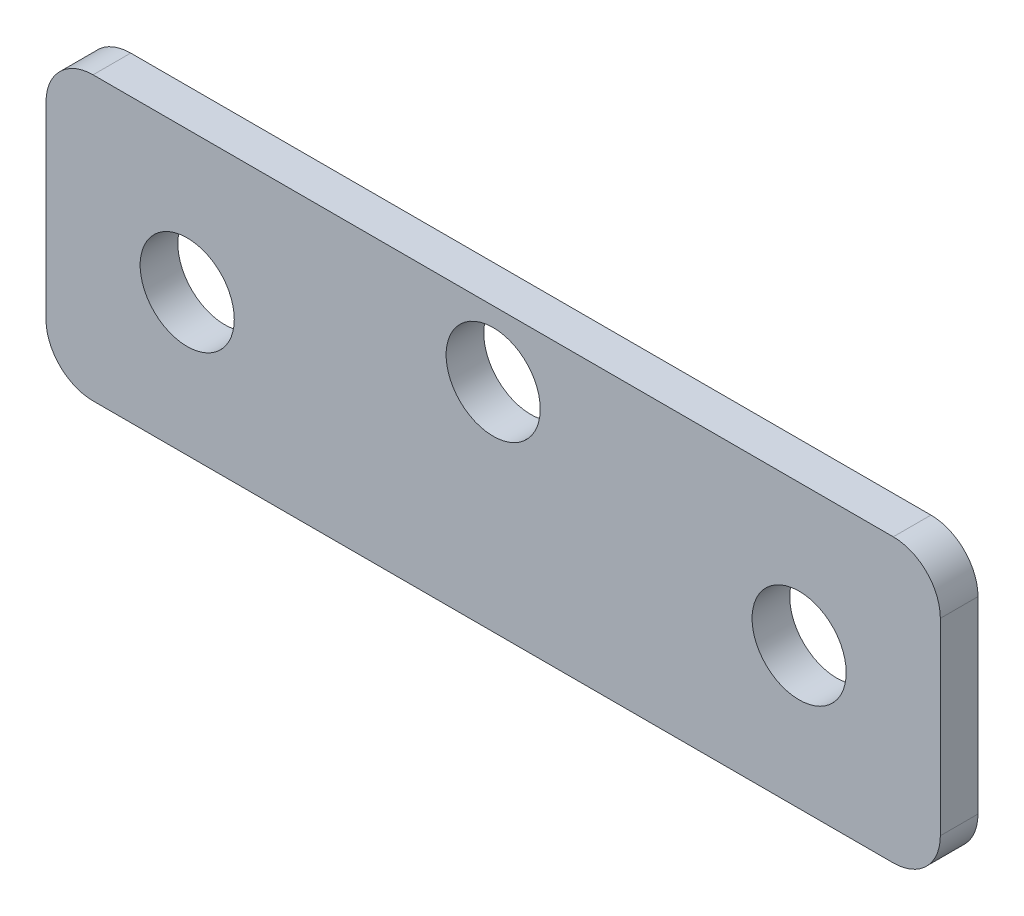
ISO-10303-21;
HEADER;
FILE_DESCRIPTION(('STEP AP214'),'2;1');
FILE_NAME('part.step','',(''),(''),'','','');
FILE_SCHEMA(('AUTOMOTIVE_DESIGN { 1 0 10303 214 1 1 1 1 }'));
ENDSEC;
DATA;
#1=APPLICATION_CONTEXT('core data for automotive mechanical design processes');
#2=APPLICATION_PROTOCOL_DEFINITION('international standard','automotive_design',2000,#1);
#3=PRODUCT_CONTEXT('',#1,'mechanical');
#4=PRODUCT('Part','Part','',(#3));
#5=PRODUCT_RELATED_PRODUCT_CATEGORY('part','',(#4));
#6=PRODUCT_DEFINITION_FORMATION('','',#4);
#7=PRODUCT_DEFINITION_CONTEXT('part definition',#1,'design');
#8=PRODUCT_DEFINITION('design','',#6,#7);
#9=PRODUCT_DEFINITION_SHAPE('','',#8);
#10=(LENGTH_UNIT() NAMED_UNIT(*) SI_UNIT(.MILLI.,.METRE.));
#11=(NAMED_UNIT(*) PLANE_ANGLE_UNIT() SI_UNIT($,.RADIAN.));
#12=(NAMED_UNIT(*) SI_UNIT($,.STERADIAN.) SOLID_ANGLE_UNIT());
#13=UNCERTAINTY_MEASURE_WITH_UNIT(LENGTH_MEASURE(1.E-05),#10,'distance_accuracy_value','');
#14=(GEOMETRIC_REPRESENTATION_CONTEXT(3) GLOBAL_UNCERTAINTY_ASSIGNED_CONTEXT((#13)) GLOBAL_UNIT_ASSIGNED_CONTEXT((#10,
#11,#12)) REPRESENTATION_CONTEXT('',''));
#15=CARTESIAN_POINT('',(0.,0.,0.));
#16=DIRECTION('',(0.,0.,1.));
#17=DIRECTION('',(1.,0.,0.));
#18=AXIS2_PLACEMENT_3D('',#15,#16,#17);
#19=CARTESIAN_POINT('',(-75.,10.,0.));
#20=DIRECTION('',(0.,0.,-1.));
#21=DIRECTION('',(-1.,0.,0.));
#22=AXIS2_PLACEMENT_3D('',#19,#20,#21);
#23=PLANE('',#22);
#24=CARTESIAN_POINT('',(-65.,0.,0.));
#25=DIRECTION('',(0.,0.,1.));
#26=DIRECTION('',(1.,0.,0.));
#27=AXIS2_PLACEMENT_3D('',#24,#25,#26);
#28=CIRCLE('',#27,5.);
#29=CARTESIAN_POINT('',(-60.,0.,0.));
#30=VERTEX_POINT('',#29);
#31=EDGE_CURVE('E193',#30,#30,#28,.T.);
#32=ORIENTED_EDGE('',*,*,#31,.T.);
#33=EDGE_LOOP('',(#32));
#34=FACE_BOUND('',#33,.T.);
#35=CARTESIAN_POINT('',(-75.,10.,0.));
#36=DIRECTION('',(0.,0.,-1.));
#37=DIRECTION('',(-1.,0.,0.));
#38=AXIS2_PLACEMENT_3D('',#35,#36,#37);
#39=CIRCLE('',#38,5.);
#40=CARTESIAN_POINT('',(-80.,9.99999999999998,0.));
#41=VERTEX_POINT('',#40);
#42=CARTESIAN_POINT('',(-75.,15.,0.));
#43=VERTEX_POINT('',#42);
#44=EDGE_CURVE('E96',#41,#43,#39,.T.);
#45=ORIENTED_EDGE('',*,*,#44,.T.);
#46=DIRECTION('',(1.,0.,0.));
#47=VECTOR('',#46,1.);
#48=CARTESIAN_POINT('',(-75.,15.,0.));
#49=LINE('',#48,#47);
#50=CARTESIAN_POINT('',(9.99999999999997,15.,0.));
#51=VERTEX_POINT('',#50);
#52=EDGE_CURVE('E103',#43,#51,#49,.T.);
#53=ORIENTED_EDGE('',*,*,#52,.T.);
#54=CARTESIAN_POINT('',(10.,10.,0.));
#55=DIRECTION('',(0.,0.,1.));
#56=DIRECTION('',(1.,0.,0.));
#57=AXIS2_PLACEMENT_3D('',#54,#55,#56);
#58=CIRCLE('',#57,5.);
#59=CARTESIAN_POINT('',(15.,9.99999999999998,0.));
#60=VERTEX_POINT('',#59);
#61=EDGE_CURVE('E109',#60,#51,#58,.T.);
#62=ORIENTED_EDGE('',*,*,#61,.F.);
#63=DIRECTION('',(0.,1.,0.));
#64=VECTOR('',#63,1.);
#65=CARTESIAN_POINT('',(15.,-9.99999999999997,0.));
#66=LINE('',#65,#64);
#67=CARTESIAN_POINT('',(15.,-9.99999999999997,0.));
#68=VERTEX_POINT('',#67);
#69=EDGE_CURVE('E124',#68,#60,#66,.T.);
#70=ORIENTED_EDGE('',*,*,#69,.F.);
#71=CARTESIAN_POINT('',(10.,-10.,0.));
#72=DIRECTION('',(0.,0.,1.));
#73=DIRECTION('',(1.,0.,0.));
#74=AXIS2_PLACEMENT_3D('',#71,#72,#73);
#75=CIRCLE('',#74,5.);
#76=CARTESIAN_POINT('',(9.99999999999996,-15.,0.));
#77=VERTEX_POINT('',#76);
#78=EDGE_CURVE('E126',#77,#68,#75,.T.);
#79=ORIENTED_EDGE('',*,*,#78,.F.);
#80=DIRECTION('',(-1.,0.,0.));
#81=VECTOR('',#80,1.);
#82=CARTESIAN_POINT('',(9.99999999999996,-15.,0.));
#83=LINE('',#82,#81);
#84=CARTESIAN_POINT('',(-75.,-15.,0.));
#85=VERTEX_POINT('',#84);
#86=EDGE_CURVE('E128',#77,#85,#83,.T.);
#87=ORIENTED_EDGE('',*,*,#86,.T.);
#88=CARTESIAN_POINT('',(-75.,-9.99999999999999,0.));
#89=DIRECTION('',(0.,0.,-1.));
#90=DIRECTION('',(-1.,0.,0.));
#91=AXIS2_PLACEMENT_3D('',#88,#89,#90);
#92=CIRCLE('',#91,5.);
#93=CARTESIAN_POINT('',(-80.,-9.99999999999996,0.));
#94=VERTEX_POINT('',#93);
#95=EDGE_CURVE('E131',#85,#94,#92,.T.);
#96=ORIENTED_EDGE('',*,*,#95,.T.);
#97=DIRECTION('',(0.,-1.,0.));
#98=VECTOR('',#97,1.);
#99=CARTESIAN_POINT('',(-80.,9.99999999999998,0.));
#100=LINE('',#99,#98);
#101=EDGE_CURVE('E115',#41,#94,#100,.T.);
#102=ORIENTED_EDGE('',*,*,#101,.F.);
#103=EDGE_LOOP('',(#45,#53,#62,#70,#79,#87,#96,#102));
#104=FACE_BOUND('',#103,.T.);
#105=CARTESIAN_POINT('',(0.,0.,0.));
#106=DIRECTION('',(0.,0.,1.));
#107=DIRECTION('',(1.,0.,0.));
#108=AXIS2_PLACEMENT_3D('',#105,#106,#107);
#109=CIRCLE('',#108,5.);
#110=CARTESIAN_POINT('',(5.,0.,0.));
#111=VERTEX_POINT('',#110);
#112=EDGE_CURVE('E119',#111,#111,#109,.T.);
#113=ORIENTED_EDGE('',*,*,#112,.T.);
#114=EDGE_LOOP('',(#113));
#115=FACE_BOUND('',#114,.T.);
#116=CARTESIAN_POINT('',(-32.5,7.99999999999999,0.));
#117=DIRECTION('',(0.,0.,1.));
#118=DIRECTION('',(1.,0.,0.));
#119=AXIS2_PLACEMENT_3D('',#116,#117,#118);
#120=CIRCLE('',#119,5.);
#121=CARTESIAN_POINT('',(-27.5,7.99999999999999,0.));
#122=VERTEX_POINT('',#121);
#123=EDGE_CURVE('E194',#122,#122,#120,.T.);
#124=ORIENTED_EDGE('',*,*,#123,.T.);
#125=EDGE_LOOP('',(#124));
#126=FACE_BOUND('',#125,.T.);
#127=ADVANCED_FACE('F30',(#34,#104,#115,#126),#23,.T.);
#128=CARTESIAN_POINT('',(-75.,10.,4.));
#129=DIRECTION('',(0.,0.,-1.));
#130=DIRECTION('',(-1.,0.,0.));
#131=AXIS2_PLACEMENT_3D('',#128,#129,#130);
#132=PLANE('',#131);
#133=CARTESIAN_POINT('',(-65.,0.,4.));
#134=DIRECTION('',(0.,0.,1.));
#135=DIRECTION('',(1.,0.,0.));
#136=AXIS2_PLACEMENT_3D('',#133,#134,#135);
#137=CIRCLE('',#136,5.);
#138=CARTESIAN_POINT('',(-60.,0.,4.));
#139=VERTEX_POINT('',#138);
#140=EDGE_CURVE('E197',#139,#139,#137,.T.);
#141=ORIENTED_EDGE('',*,*,#140,.F.);
#142=EDGE_LOOP('',(#141));
#143=FACE_BOUND('',#142,.T.);
#144=CARTESIAN_POINT('',(-75.,10.,4.));
#145=DIRECTION('',(0.,0.,-1.));
#146=DIRECTION('',(-1.,0.,0.));
#147=AXIS2_PLACEMENT_3D('',#144,#145,#146);
#148=CIRCLE('',#147,5.);
#149=CARTESIAN_POINT('',(-80.,9.99999999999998,4.));
#150=VERTEX_POINT('',#149);
#151=CARTESIAN_POINT('',(-75.,15.,4.));
#152=VERTEX_POINT('',#151);
#153=EDGE_CURVE('E97',#150,#152,#148,.T.);
#154=ORIENTED_EDGE('',*,*,#153,.F.);
#155=DIRECTION('',(0.,-1.,0.));
#156=VECTOR('',#155,1.);
#157=CARTESIAN_POINT('',(-80.,9.99999999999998,4.));
#158=LINE('',#157,#156);
#159=CARTESIAN_POINT('',(-80.,-9.99999999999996,4.));
#160=VERTEX_POINT('',#159);
#161=EDGE_CURVE('E52',#150,#160,#158,.T.);
#162=ORIENTED_EDGE('',*,*,#161,.T.);
#163=CARTESIAN_POINT('',(-75.,-9.99999999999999,4.));
#164=DIRECTION('',(0.,0.,-1.));
#165=DIRECTION('',(-1.,0.,0.));
#166=AXIS2_PLACEMENT_3D('',#163,#164,#165);
#167=CIRCLE('',#166,5.);
#168=CARTESIAN_POINT('',(-75.,-15.,4.));
#169=VERTEX_POINT('',#168);
#170=EDGE_CURVE('E146',#169,#160,#167,.T.);
#171=ORIENTED_EDGE('',*,*,#170,.F.);
#172=DIRECTION('',(-1.,0.,0.));
#173=VECTOR('',#172,1.);
#174=CARTESIAN_POINT('',(9.99999999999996,-15.,4.));
#175=LINE('',#174,#173);
#176=CARTESIAN_POINT('',(9.99999999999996,-15.,4.));
#177=VERTEX_POINT('',#176);
#178=EDGE_CURVE('E143',#177,#169,#175,.T.);
#179=ORIENTED_EDGE('',*,*,#178,.F.);
#180=CARTESIAN_POINT('',(10.,-10.,4.));
#181=DIRECTION('',(0.,0.,1.));
#182=DIRECTION('',(1.,0.,0.));
#183=AXIS2_PLACEMENT_3D('',#180,#181,#182);
#184=CIRCLE('',#183,5.);
#185=CARTESIAN_POINT('',(15.,-9.99999999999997,4.));
#186=VERTEX_POINT('',#185);
#187=EDGE_CURVE('E141',#177,#186,#184,.T.);
#188=ORIENTED_EDGE('',*,*,#187,.T.);
#189=DIRECTION('',(0.,1.,0.));
#190=VECTOR('',#189,1.);
#191=CARTESIAN_POINT('',(15.,-9.99999999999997,4.));
#192=LINE('',#191,#190);
#193=CARTESIAN_POINT('',(15.,9.99999999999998,4.));
#194=VERTEX_POINT('',#193);
#195=EDGE_CURVE('E139',#186,#194,#192,.T.);
#196=ORIENTED_EDGE('',*,*,#195,.T.);
#197=CARTESIAN_POINT('',(10.,10.,4.));
#198=DIRECTION('',(0.,0.,1.));
#199=DIRECTION('',(1.,0.,0.));
#200=AXIS2_PLACEMENT_3D('',#197,#198,#199);
#201=CIRCLE('',#200,5.);
#202=CARTESIAN_POINT('',(9.99999999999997,15.,4.));
#203=VERTEX_POINT('',#202);
#204=EDGE_CURVE('E137',#194,#203,#201,.T.);
#205=ORIENTED_EDGE('',*,*,#204,.T.);
#206=DIRECTION('',(1.,0.,0.));
#207=VECTOR('',#206,1.);
#208=CARTESIAN_POINT('',(-75.,15.,4.));
#209=LINE('',#208,#207);
#210=EDGE_CURVE('E135',#152,#203,#209,.T.);
#211=ORIENTED_EDGE('',*,*,#210,.F.);
#212=EDGE_LOOP('',(#154,#162,#171,#179,#188,#196,#205,#211));
#213=FACE_BOUND('',#212,.T.);
#214=CARTESIAN_POINT('',(0.,0.,4.));
#215=DIRECTION('',(0.,0.,1.));
#216=DIRECTION('',(1.,0.,0.));
#217=AXIS2_PLACEMENT_3D('',#214,#215,#216);
#218=CIRCLE('',#217,5.);
#219=CARTESIAN_POINT('',(5.,0.,4.));
#220=VERTEX_POINT('',#219);
#221=EDGE_CURVE('E116',#220,#220,#218,.T.);
#222=ORIENTED_EDGE('',*,*,#221,.F.);
#223=EDGE_LOOP('',(#222));
#224=FACE_BOUND('',#223,.T.);
#225=CARTESIAN_POINT('',(-32.5,7.99999999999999,4.));
#226=DIRECTION('',(0.,0.,1.));
#227=DIRECTION('',(1.,0.,0.));
#228=AXIS2_PLACEMENT_3D('',#225,#226,#227);
#229=CIRCLE('',#228,5.);
#230=CARTESIAN_POINT('',(-27.5,7.99999999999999,4.));
#231=VERTEX_POINT('',#230);
#232=EDGE_CURVE('E191',#231,#231,#229,.T.);
#233=ORIENTED_EDGE('',*,*,#232,.F.);
#234=EDGE_LOOP('',(#233));
#235=FACE_BOUND('',#234,.T.);
#236=ADVANCED_FACE('F182',(#143,#213,#224,#235),#132,.F.);
#237=CARTESIAN_POINT('',(-75.,10.,4.));
#238=DIRECTION('',(0.,0.,-1.));
#239=DIRECTION('',(-1.,0.,0.));
#240=AXIS2_PLACEMENT_3D('',#237,#238,#239);
#241=CYLINDRICAL_SURFACE('',#240,5.);
#242=ORIENTED_EDGE('',*,*,#44,.F.);
#243=DIRECTION('',(0.,0.,-1.));
#244=VECTOR('',#243,1.);
#245=CARTESIAN_POINT('',(-80.,9.99999999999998,4.));
#246=LINE('',#245,#244);
#247=EDGE_CURVE('E11',#150,#41,#246,.T.);
#248=ORIENTED_EDGE('',*,*,#247,.F.);
#249=ORIENTED_EDGE('',*,*,#153,.T.);
#250=DIRECTION('',(0.,0.,-1.));
#251=VECTOR('',#250,1.);
#252=CARTESIAN_POINT('',(-75.,15.,4.));
#253=LINE('',#252,#251);
#254=EDGE_CURVE('E34',#152,#43,#253,.T.);
#255=ORIENTED_EDGE('',*,*,#254,.T.);
#256=EDGE_LOOP('',(#242,#248,#249,#255));
#257=FACE_BOUND('',#256,.T.);
#258=ADVANCED_FACE('F32',(#257),#241,.T.);
#259=CARTESIAN_POINT('',(-80.,9.99999999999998,4.));
#260=DIRECTION('',(1.,0.,0.));
#261=DIRECTION('',(0.,0.,-1.));
#262=AXIS2_PLACEMENT_3D('',#259,#260,#261);
#263=PLANE('',#262);
#264=ORIENTED_EDGE('',*,*,#101,.T.);
#265=DIRECTION('',(0.,0.,-1.));
#266=VECTOR('',#265,1.);
#267=CARTESIAN_POINT('',(-80.,-9.99999999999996,4.));
#268=LINE('',#267,#266);
#269=EDGE_CURVE('E39',#160,#94,#268,.T.);
#270=ORIENTED_EDGE('',*,*,#269,.F.);
#271=ORIENTED_EDGE('',*,*,#161,.F.);
#272=ORIENTED_EDGE('',*,*,#247,.T.);
#273=EDGE_LOOP('',(#264,#270,#271,#272));
#274=FACE_BOUND('',#273,.T.);
#275=ADVANCED_FACE('F181',(#274),#263,.F.);
#276=CARTESIAN_POINT('',(-75.,-9.99999999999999,4.));
#277=DIRECTION('',(0.,0.,-1.));
#278=DIRECTION('',(-1.,0.,0.));
#279=AXIS2_PLACEMENT_3D('',#276,#277,#278);
#280=CYLINDRICAL_SURFACE('',#279,5.);
#281=ORIENTED_EDGE('',*,*,#95,.F.);
#282=DIRECTION('',(0.,0.,-1.));
#283=VECTOR('',#282,1.);
#284=CARTESIAN_POINT('',(-75.,-15.,4.));
#285=LINE('',#284,#283);
#286=EDGE_CURVE('E151',#169,#85,#285,.T.);
#287=ORIENTED_EDGE('',*,*,#286,.F.);
#288=ORIENTED_EDGE('',*,*,#170,.T.);
#289=ORIENTED_EDGE('',*,*,#269,.T.);
#290=EDGE_LOOP('',(#281,#287,#288,#289));
#291=FACE_BOUND('',#290,.T.);
#292=ADVANCED_FACE('F179',(#291),#280,.T.);
#293=CARTESIAN_POINT('',(9.99999999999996,-15.,4.));
#294=DIRECTION('',(0.,-1.,0.));
#295=DIRECTION('',(1.,0.,0.));
#296=AXIS2_PLACEMENT_3D('',#293,#294,#295);
#297=PLANE('',#296);
#298=ORIENTED_EDGE('',*,*,#86,.F.);
#299=DIRECTION('',(0.,0.,-1.));
#300=VECTOR('',#299,1.);
#301=CARTESIAN_POINT('',(9.99999999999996,-15.,4.));
#302=LINE('',#301,#300);
#303=EDGE_CURVE('E153',#177,#77,#302,.T.);
#304=ORIENTED_EDGE('',*,*,#303,.F.);
#305=ORIENTED_EDGE('',*,*,#178,.T.);
#306=ORIENTED_EDGE('',*,*,#286,.T.);
#307=EDGE_LOOP('',(#298,#304,#305,#306));
#308=FACE_BOUND('',#307,.T.);
#309=ADVANCED_FACE('F176',(#308),#297,.T.);
#310=CARTESIAN_POINT('',(10.,-10.,4.));
#311=DIRECTION('',(0.,0.,-1.));
#312=DIRECTION('',(-1.,0.,0.));
#313=AXIS2_PLACEMENT_3D('',#310,#311,#312);
#314=CYLINDRICAL_SURFACE('',#313,5.);
#315=ORIENTED_EDGE('',*,*,#78,.T.);
#316=DIRECTION('',(0.,0.,-1.));
#317=VECTOR('',#316,1.);
#318=CARTESIAN_POINT('',(15.,-9.99999999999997,4.));
#319=LINE('',#318,#317);
#320=EDGE_CURVE('E155',#186,#68,#319,.T.);
#321=ORIENTED_EDGE('',*,*,#320,.F.);
#322=ORIENTED_EDGE('',*,*,#187,.F.);
#323=ORIENTED_EDGE('',*,*,#303,.T.);
#324=EDGE_LOOP('',(#315,#321,#322,#323));
#325=FACE_BOUND('',#324,.T.);
#326=ADVANCED_FACE('F173',(#325),#314,.T.);
#327=CARTESIAN_POINT('',(15.,-9.99999999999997,4.));
#328=DIRECTION('',(-1.,0.,0.));
#329=DIRECTION('',(0.,0.,1.));
#330=AXIS2_PLACEMENT_3D('',#327,#328,#329);
#331=PLANE('',#330);
#332=ORIENTED_EDGE('',*,*,#69,.T.);
#333=DIRECTION('',(0.,0.,-1.));
#334=VECTOR('',#333,1.);
#335=CARTESIAN_POINT('',(15.,9.99999999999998,4.));
#336=LINE('',#335,#334);
#337=EDGE_CURVE('E158',#194,#60,#336,.T.);
#338=ORIENTED_EDGE('',*,*,#337,.F.);
#339=ORIENTED_EDGE('',*,*,#195,.F.);
#340=ORIENTED_EDGE('',*,*,#320,.T.);
#341=EDGE_LOOP('',(#332,#338,#339,#340));
#342=FACE_BOUND('',#341,.T.);
#343=ADVANCED_FACE('F169',(#342),#331,.F.);
#344=CARTESIAN_POINT('',(10.,10.,4.));
#345=DIRECTION('',(0.,0.,-1.));
#346=DIRECTION('',(-1.,0.,0.));
#347=AXIS2_PLACEMENT_3D('',#344,#345,#346);
#348=CYLINDRICAL_SURFACE('',#347,5.);
#349=ORIENTED_EDGE('',*,*,#61,.T.);
#350=DIRECTION('',(0.,0.,-1.));
#351=VECTOR('',#350,1.);
#352=CARTESIAN_POINT('',(9.99999999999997,15.,4.));
#353=LINE('',#352,#351);
#354=EDGE_CURVE('E101',#203,#51,#353,.T.);
#355=ORIENTED_EDGE('',*,*,#354,.F.);
#356=ORIENTED_EDGE('',*,*,#204,.F.);
#357=ORIENTED_EDGE('',*,*,#337,.T.);
#358=EDGE_LOOP('',(#349,#355,#356,#357));
#359=FACE_BOUND('',#358,.T.);
#360=ADVANCED_FACE('F163',(#359),#348,.T.);
#361=CARTESIAN_POINT('',(-75.,15.,4.));
#362=DIRECTION('',(0.,1.,0.));
#363=DIRECTION('',(0.,0.,1.));
#364=AXIS2_PLACEMENT_3D('',#361,#362,#363);
#365=PLANE('',#364);
#366=ORIENTED_EDGE('',*,*,#52,.F.);
#367=ORIENTED_EDGE('',*,*,#254,.F.);
#368=ORIENTED_EDGE('',*,*,#210,.T.);
#369=ORIENTED_EDGE('',*,*,#354,.T.);
#370=EDGE_LOOP('',(#366,#367,#368,#369));
#371=FACE_BOUND('',#370,.T.);
#372=ADVANCED_FACE('F104',(#371),#365,.T.);
#373=CARTESIAN_POINT('',(0.,0.,4.));
#374=DIRECTION('',(0.,0.,-1.));
#375=DIRECTION('',(-1.,0.,0.));
#376=AXIS2_PLACEMENT_3D('',#373,#374,#375);
#377=CYLINDRICAL_SURFACE('',#376,5.);
#378=ORIENTED_EDGE('',*,*,#221,.T.);
#379=EDGE_LOOP('',(#378));
#380=FACE_BOUND('',#379,.T.);
#381=ORIENTED_EDGE('',*,*,#112,.F.);
#382=EDGE_LOOP('',(#381));
#383=FACE_BOUND('',#382,.T.);
#384=ADVANCED_FACE('F207',(#380,#383),#377,.F.);
#385=CARTESIAN_POINT('',(-65.,0.,4.));
#386=DIRECTION('',(0.,0.,-1.));
#387=DIRECTION('',(-1.,0.,0.));
#388=AXIS2_PLACEMENT_3D('',#385,#386,#387);
#389=CYLINDRICAL_SURFACE('',#388,5.);
#390=ORIENTED_EDGE('',*,*,#140,.T.);
#391=EDGE_LOOP('',(#390));
#392=FACE_BOUND('',#391,.T.);
#393=ORIENTED_EDGE('',*,*,#31,.F.);
#394=EDGE_LOOP('',(#393));
#395=FACE_BOUND('',#394,.T.);
#396=ADVANCED_FACE('F209',(#392,#395),#389,.F.);
#397=CARTESIAN_POINT('',(-32.5,7.99999999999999,4.));
#398=DIRECTION('',(0.,0.,-1.));
#399=DIRECTION('',(-1.,0.,0.));
#400=AXIS2_PLACEMENT_3D('',#397,#398,#399);
#401=CYLINDRICAL_SURFACE('',#400,5.);
#402=ORIENTED_EDGE('',*,*,#232,.T.);
#403=EDGE_LOOP('',(#402));
#404=FACE_BOUND('',#403,.T.);
#405=ORIENTED_EDGE('',*,*,#123,.F.);
#406=EDGE_LOOP('',(#405));
#407=FACE_BOUND('',#406,.T.);
#408=ADVANCED_FACE('F216',(#404,#407),#401,.F.);
#409=CLOSED_SHELL('',(#127,#236,#258,#275,#292,#309,#326,#343,#360,#372,#384,#396,#408));
#410=MANIFOLD_SOLID_BREP('B2',#409);
#411=ADVANCED_BREP_SHAPE_REPRESENTATION('',(#18,#410),#14);
#412=SHAPE_DEFINITION_REPRESENTATION(#9,#411);
ENDSEC;
END-ISO-10303-21;
